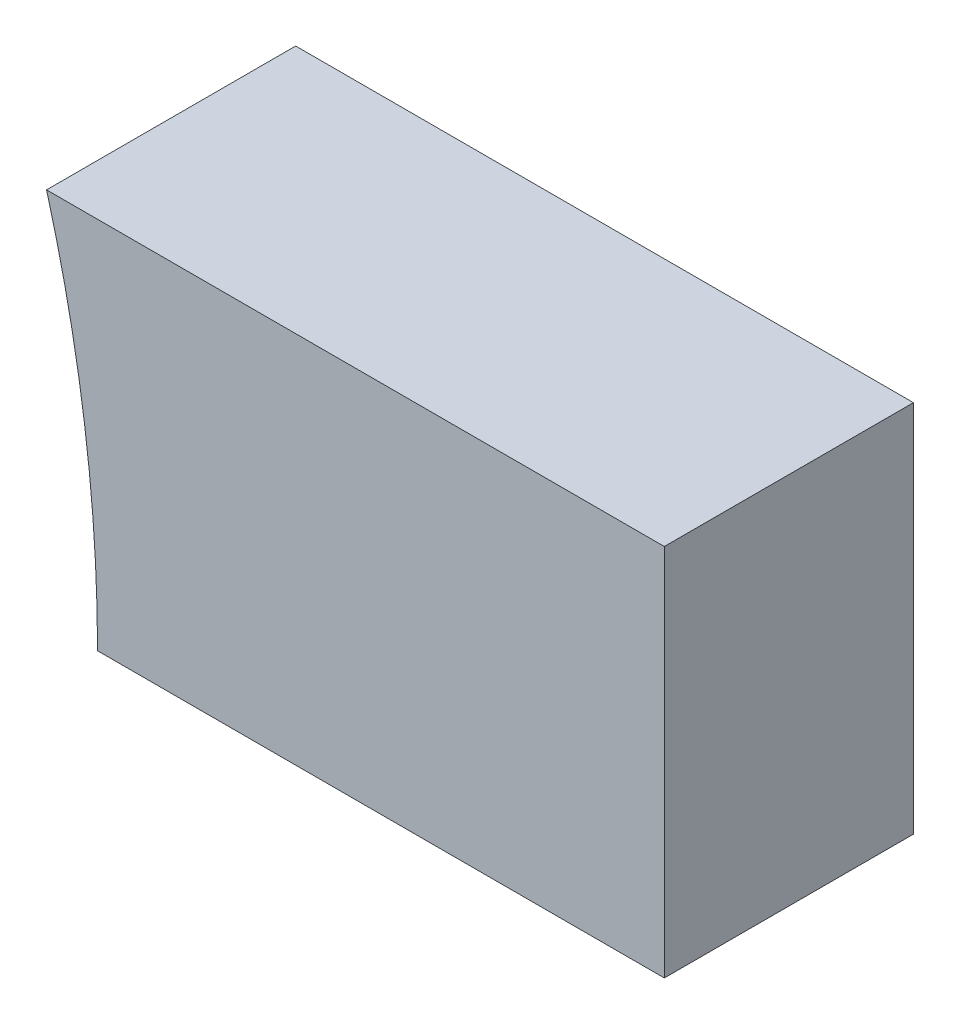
from build123d import *

# Parameters (mm, degrees)
EXTRUSION1_DEPTH = 20


with BuildPart() as part:
    # Esquisse1 → Extrusion1 (new body)
    with BuildSketch(Plane.XY):
        with BuildLine():
            Line((107.907367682, 30), (157.5, 30))
            Line((157.5, 30), (157.5, 0))
            Line((157.5, 0), (112, 0))
            ThreePointArc((112, 0), (110.972125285, 15.138936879), (107.907367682, 30))
        make_face()
    extrude(amount=EXTRUSION1_DEPTH)


solid = part.part
